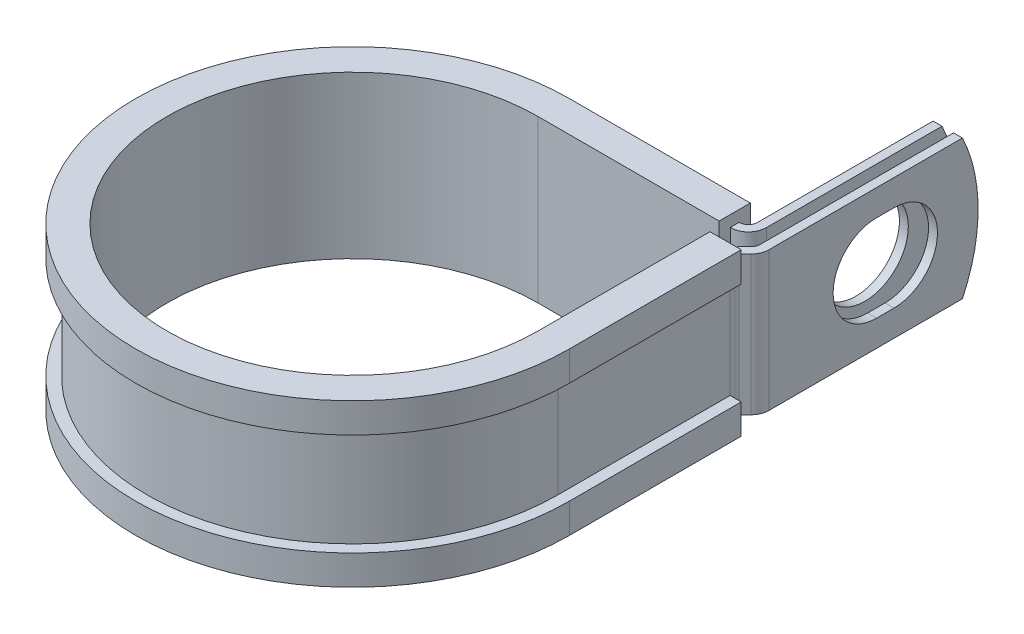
from build123d import *

# Parameters (mm, degrees)
EXTRUDE_THIN1_DEPTH = 9.525
SKETCH2_R           = 5.9436
CUT_EXTRUDE1_DEPTH  = 1.2192
CUT_EXTRUDE2_DEPTH  = 1.2192
CUT_EXTRUDE3_DEPTH  = 79.172676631


with BuildPart() as part:
    # Sketch1 → Extrude-Thin1 (new, symmetric)
    with BuildSketch(Plane(origin=(0, 0, 0), x_dir=(1, 0, 0), z_dir=(0, 1, 0))):
        with BuildLine():
            Line((28.8214698, 55.5498), (28.8214698, 26.924))
            ThreePointArc((28.8214698, 26.924), (28.728663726, 26.457432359), (28.464374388, 26.061895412))
            Line((28.464374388, 26.061895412), (27.638190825, 25.235711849))
            ThreePointArc((27.638190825, 25.235711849), (27.109612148, 24.444637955), (26.924, 23.511502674))
            Line((26.924, 23.511502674), (26.924, 0))
            ThreePointArc((26.924, 0), (-19.038142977, -19.038142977), (0, 26.924))
            Line((0, 26.924), (24.8082698, 26.924))
            ThreePointArc((24.8082698, 26.924), (26.532478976, 27.638190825), (27.2466698, 29.3624))
            Line((27.2466698, 29.3624), (27.2466698, 55.5498))
            Line((27.2466698, 55.5498), (26.0274698, 55.5498))
            Line((26.0274698, 55.5498), (26.0274698, 29.3624))
            ThreePointArc((26.0274698, 29.3624), (25.670374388, 28.500295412), (24.8082698, 28.1432))
            Line((24.8082698, 28.1432), (0, 28.1432))
            ThreePointArc((0, 28.1432), (-19.900247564, -19.900247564), (28.1432, 0))
            Line((28.1432, 0), (28.1432, 23.511502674))
            ThreePointArc((28.1432, 23.511502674), (28.236006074, 23.978070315), (28.500295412, 24.373607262))
            Line((28.500295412, 24.373607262), (29.326478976, 25.199790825))
            ThreePointArc((29.326478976, 25.199790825), (29.855057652, 25.990864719), (30.0406698, 26.924))
            Line((30.0406698, 26.924), (30.0406698, 55.5498))
            Line((30.0406698, 55.5498), (28.8214698, 55.5498))
        make_face()
    extrude(amount=EXTRUDE_THIN1_DEPTH, both=True)

    # Sketch2 → Cut-Extrude1 (cut)
    with BuildSketch(Plane.ZY.offset(-26.0274698)):
        with Locations((-42.8498, 0)):
            Circle(SKETCH2_R)
    extrude(amount=-CUT_EXTRUDE1_DEPTH, mode=Mode.SUBTRACT)

    # Sketch3 → Cut-Extrude2 (cut)
    with BuildSketch(Plane(origin=(30.0406698, 0, 0), x_dir=(0, 0, -1), z_dir=(1, 0, 0))):
        with BuildLine():
            Line((41.656, 5.9436), (44.0436, 5.9436))
            ThreePointArc((44.0436, 5.9436), (49.9872, 0), (44.0436, -5.9436))
            Line((44.0436, -5.9436), (41.656, -5.9436))
            ThreePointArc((41.656, -5.9436), (35.7124, 0), (41.656, 5.9436))
        make_face()
    extrude(amount=-CUT_EXTRUDE2_DEPTH, mode=Mode.SUBTRACT)

    # Sketch4 → Cut-Extrude3 (cut, through all)
    with BuildSketch(Plane.ZY.offset(-26.0274698)):
        with BuildLine():
            Line((-53.405263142, 9.525), (-55.5498, 9.525))
            Line((-55.5498, 9.525), (-55.5498, 0))
            ThreePointArc((-55.5498, 0), (-55.007038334, 4.881717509), (-53.405263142, 9.525))
        make_face()
        with BuildLine():
            ThreePointArc((-53.405263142, -9.525), (-55.007038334, -4.881717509), (-55.5498, 0))
            Line((-55.5498, 0), (-55.5498, -9.525))
            Line((-55.5498, -9.525), (-53.405263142, -9.525))
        make_face()
    extrude(amount=-CUT_EXTRUDE3_DEPTH, mode=Mode.SUBTRACT)

    # Sweep1: sweep along a path in Sketch6
    with BuildLine(Plane(origin=(0, 9.525, 0), x_dir=(1, 0, 0), z_dir=(0, 1, 0))) as sweep1_path:
        Line((25.4, 23.511502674), (25.4, 0))
        ThreePointArc((25.4, 0), (-17.960512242, -17.960512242), (0, 25.4))
        Line((0, 25.4), (24.7574698, 25.4))
    # Sketch5 → Sweep1 (sweep)
    with BuildSketch(Plane(origin=(0, 0, -23.511502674), x_dir=(-1, 0, 0), z_dir=(0, 0, -1))):
        Polygon((-28.1432, 9.525), (-26.924, 9.525), (-26.924, -9.525), (-28.1432, -9.525), (-28.1432, -6.985), (-29.6672, -6.985), (-29.6672, -11.049), (-25.4, -11.049), (-25.4, 11.049), (-29.6672, 11.049), (-29.6672, 6.985), (-28.1432, 6.985), align=None)
    sweep(path=sweep1_path.line)


solid = part.part
